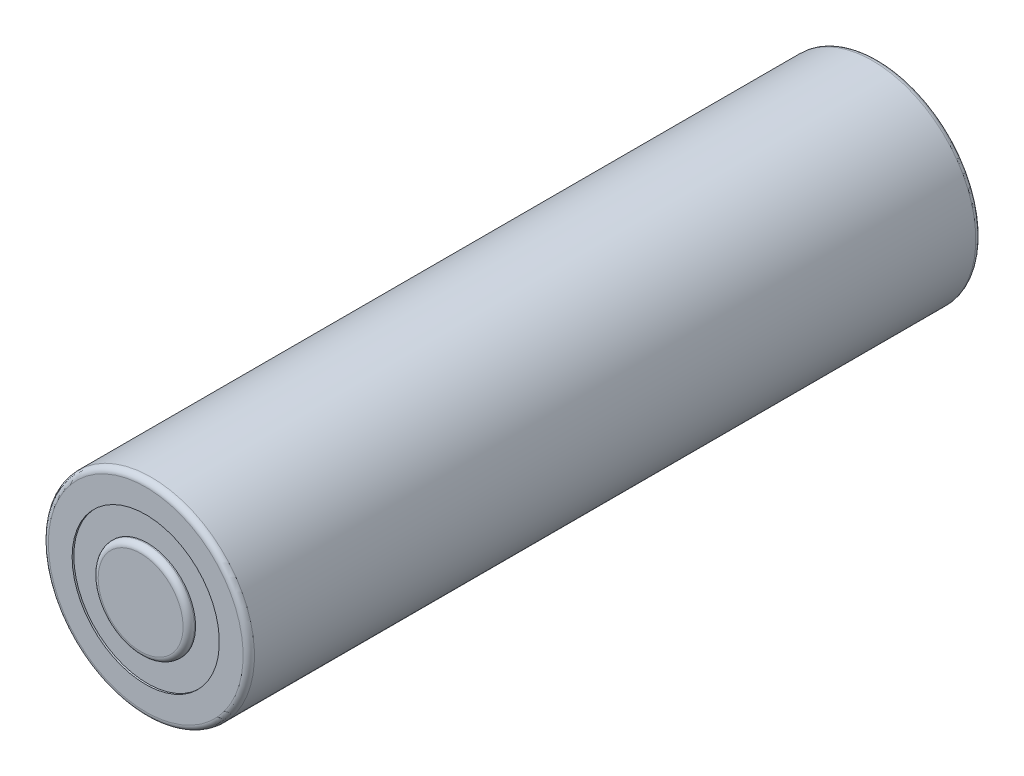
from build123d import *


with BuildPart() as part:
    # Sketch1 → Revolve1 (revolve)
    with BuildSketch(Plane.XZ.offset(-15.271996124), mode=Mode.PRIVATE) as revolve1_sk:
        with BuildLine():
            Line((-25.124360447, 65.15), (-28.874360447, 65.15))
            Line((-28.874360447, 65.15), (-28.874360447, 0.35))
            Line((-28.874360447, 0.35), (-22.374360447, 0.35))
            Line((-22.374360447, 0.35), (-22.374360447, 0))
            Line((-22.374360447, 0), (-20.274360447, 0))
            ThreePointArc((-20.274360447, 0), (-19.920807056, 0.146446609), (-19.774360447, 0.5))
            Line((-19.774360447, 0.5), (-19.774360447, 64.2))
            ThreePointArc((-19.774360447, 64.2), (-19.920807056, 64.553553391), (-20.274360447, 64.7))
            Line((-20.274360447, 64.7), (-22.374360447, 64.7))
            Line((-22.374360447, 64.7), (-22.374360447, 64.55))
            Line((-22.374360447, 64.55), (-24.624360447, 64.55))
            Line((-24.624360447, 64.55), (-24.624360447, 64.65))
            ThreePointArc((-24.624360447, 64.65), (-24.770807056, 65.003553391), (-25.124360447, 65.15))
        make_face()
    revolve(revolve1_sk.sketch.rotate(Axis((-28.874360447, 15.271996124, 65.15), (0, 0, -1)), 180), axis=Axis((-28.874360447, 15.271996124, 65.15), (0, 0, -1)))


solid = part.part
